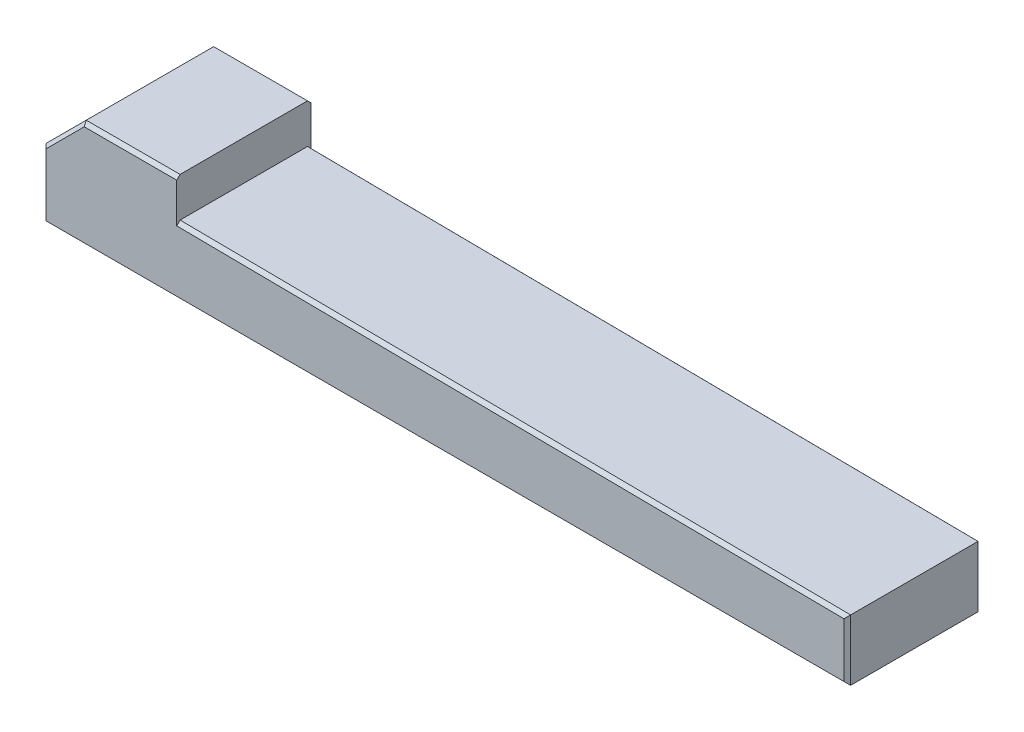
ISO-10303-21;
HEADER;
FILE_DESCRIPTION(('STEP AP214'),'2;1');
FILE_NAME('part.step','',(''),(''),'','','');
FILE_SCHEMA(('AUTOMOTIVE_DESIGN { 1 0 10303 214 1 1 1 1 }'));
ENDSEC;
DATA;
#1=APPLICATION_CONTEXT('core data for automotive mechanical design processes');
#2=APPLICATION_PROTOCOL_DEFINITION('international standard','automotive_design',2000,#1);
#3=PRODUCT_CONTEXT('',#1,'mechanical');
#4=PRODUCT('Part','Part','',(#3));
#5=PRODUCT_RELATED_PRODUCT_CATEGORY('part','',(#4));
#6=PRODUCT_DEFINITION_FORMATION('','',#4);
#7=PRODUCT_DEFINITION_CONTEXT('part definition',#1,'design');
#8=PRODUCT_DEFINITION('design','',#6,#7);
#9=PRODUCT_DEFINITION_SHAPE('','',#8);
#10=(LENGTH_UNIT() NAMED_UNIT(*) SI_UNIT(.MILLI.,.METRE.));
#11=(NAMED_UNIT(*) PLANE_ANGLE_UNIT() SI_UNIT($,.RADIAN.));
#12=(NAMED_UNIT(*) SI_UNIT($,.STERADIAN.) SOLID_ANGLE_UNIT());
#13=UNCERTAINTY_MEASURE_WITH_UNIT(LENGTH_MEASURE(1.E-05),#10,'distance_accuracy_value','');
#14=(GEOMETRIC_REPRESENTATION_CONTEXT(3) GLOBAL_UNCERTAINTY_ASSIGNED_CONTEXT((#13)) GLOBAL_UNIT_ASSIGNED_CONTEXT((#10,
#11,#12)) REPRESENTATION_CONTEXT('',''));
#15=CARTESIAN_POINT('',(0.,0.,0.));
#16=DIRECTION('',(0.,0.,1.));
#17=DIRECTION('',(1.,0.,0.));
#18=AXIS2_PLACEMENT_3D('',#15,#16,#17);
#19=CARTESIAN_POINT('',(0.,50.,50.));
#20=DIRECTION('',(1.,0.,0.));
#21=DIRECTION('',(0.,1.,0.));
#22=AXIS2_PLACEMENT_3D('',#19,#20,#21);
#23=PLANE('',#22);
#24=DIRECTION('',(0.,0.,-1.));
#25=VECTOR('',#24,1.);
#26=CARTESIAN_POINT('',(0.,50.,50.));
#27=LINE('',#26,#25);
#28=CARTESIAN_POINT('',(0.,50.,47.4999999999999));
#29=VERTEX_POINT('',#28);
#30=CARTESIAN_POINT('',(0.,50.,-47.5));
#31=VERTEX_POINT('',#30);
#32=EDGE_CURVE('E148',#29,#31,#27,.T.);
#33=ORIENTED_EDGE('',*,*,#32,.T.);
#34=DIRECTION('',(0.,-1.,0.));
#35=VECTOR('',#34,1.);
#36=CARTESIAN_POINT('',(0.,50.,-47.5));
#37=LINE('',#36,#35);
#38=CARTESIAN_POINT('',(0.,0.,-47.5));
#39=VERTEX_POINT('',#38);
#40=EDGE_CURVE('E256',#31,#39,#37,.T.);
#41=ORIENTED_EDGE('',*,*,#40,.T.);
#42=DIRECTION('',(0.,0.,-1.));
#43=VECTOR('',#42,1.);
#44=CARTESIAN_POINT('',(0.,0.,50.));
#45=LINE('',#44,#43);
#46=CARTESIAN_POINT('',(0.,0.,47.4999999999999));
#47=VERTEX_POINT('',#46);
#48=EDGE_CURVE('E169',#47,#39,#45,.T.);
#49=ORIENTED_EDGE('',*,*,#48,.F.);
#50=DIRECTION('',(0.,1.,0.));
#51=VECTOR('',#50,1.);
#52=CARTESIAN_POINT('',(0.,50.,47.4999999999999));
#53=LINE('',#52,#51);
#54=EDGE_CURVE('E253',#47,#29,#53,.T.);
#55=ORIENTED_EDGE('',*,*,#54,.T.);
#56=EDGE_LOOP('',(#33,#41,#49,#55));
#57=FACE_BOUND('',#56,.T.);
#58=ADVANCED_FACE('F39',(#57),#23,.F.);
#59=CARTESIAN_POINT('',(0.,0.,50.));
#60=DIRECTION('',(0.,1.,0.));
#61=DIRECTION('',(0.,0.,1.));
#62=AXIS2_PLACEMENT_3D('',#59,#60,#61);
#63=PLANE('',#62);
#64=ORIENTED_EDGE('',*,*,#48,.T.);
#65=DIRECTION('',(1.,0.,0.));
#66=VECTOR('',#65,1.);
#67=CARTESIAN_POINT('',(0.,0.,-47.5));
#68=LINE('',#67,#66);
#69=CARTESIAN_POINT('',(600.,0.,-47.5));
#70=VERTEX_POINT('',#69);
#71=EDGE_CURVE('E263',#39,#70,#68,.T.);
#72=ORIENTED_EDGE('',*,*,#71,.T.);
#73=DIRECTION('',(0.,0.,-1.));
#74=VECTOR('',#73,1.);
#75=CARTESIAN_POINT('',(600.,0.,50.));
#76=LINE('',#75,#74);
#77=CARTESIAN_POINT('',(600.,0.,47.4999999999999));
#78=VERTEX_POINT('',#77);
#79=EDGE_CURVE('E234',#78,#70,#76,.T.);
#80=ORIENTED_EDGE('',*,*,#79,.F.);
#81=DIRECTION('',(-1.,0.,0.));
#82=VECTOR('',#81,1.);
#83=CARTESIAN_POINT('',(0.,0.,47.4999999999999));
#84=LINE('',#83,#82);
#85=EDGE_CURVE('E258',#78,#47,#84,.T.);
#86=ORIENTED_EDGE('',*,*,#85,.T.);
#87=EDGE_LOOP('',(#64,#72,#80,#86));
#88=FACE_BOUND('',#87,.T.);
#89=ADVANCED_FACE('F310',(#88),#63,.F.);
#90=CARTESIAN_POINT('',(600.,0.,50.));
#91=DIRECTION('',(-1.,0.,0.));
#92=DIRECTION('',(0.,-1.,0.));
#93=AXIS2_PLACEMENT_3D('',#90,#91,#92);
#94=PLANE('',#93);
#95=ORIENTED_EDGE('',*,*,#79,.T.);
#96=DIRECTION('',(0.,1.,0.));
#97=VECTOR('',#96,1.);
#98=CARTESIAN_POINT('',(600.,0.,-47.5));
#99=LINE('',#98,#97);
#100=CARTESIAN_POINT('',(600.,45.4995184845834,-47.5));
#101=VERTEX_POINT('',#100);
#102=EDGE_CURVE('E261',#70,#101,#99,.T.);
#103=ORIENTED_EDGE('',*,*,#102,.T.);
#104=DIRECTION('',(0.,0.,-1.));
#105=VECTOR('',#104,1.);
#106=CARTESIAN_POINT('',(600.,45.4995184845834,50.));
#107=LINE('',#106,#105);
#108=CARTESIAN_POINT('',(600.,45.4995184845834,47.4999999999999));
#109=VERTEX_POINT('',#108);
#110=EDGE_CURVE('E233',#109,#101,#107,.T.);
#111=ORIENTED_EDGE('',*,*,#110,.F.);
#112=DIRECTION('',(0.,-1.,0.));
#113=VECTOR('',#112,1.);
#114=CARTESIAN_POINT('',(600.,0.,47.4999999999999));
#115=LINE('',#114,#113);
#116=EDGE_CURVE('E262',#109,#78,#115,.T.);
#117=ORIENTED_EDGE('',*,*,#116,.T.);
#118=EDGE_LOOP('',(#95,#103,#111,#117));
#119=FACE_BOUND('',#118,.T.);
#120=ADVANCED_FACE('F307',(#119),#94,.F.);
#121=CARTESIAN_POINT('',(600.,45.4995184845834,50.));
#122=DIRECTION('',(-0.0100005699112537,-0.999949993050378,0.));
#123=DIRECTION('',(0.999949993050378,-0.0100005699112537,0.));
#124=AXIS2_PLACEMENT_3D('',#121,#122,#123);
#125=PLANE('',#124);
#126=ORIENTED_EDGE('',*,*,#110,.T.);
#127=DIRECTION('',(-0.999949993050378,0.0100005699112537,0.));
#128=VECTOR('',#127,1.);
#129=CARTESIAN_POINT('',(600.,45.4995184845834,-47.5));
#130=LINE('',#129,#128);
#131=CARTESIAN_POINT('',(100.,50.500053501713,-47.5));
#132=VERTEX_POINT('',#131);
#133=EDGE_CURVE('E268',#101,#132,#130,.T.);
#134=ORIENTED_EDGE('',*,*,#133,.T.);
#135=DIRECTION('',(0.,0.,-1.));
#136=VECTOR('',#135,1.);
#137=CARTESIAN_POINT('',(100.,50.500053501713,50.));
#138=LINE('',#137,#136);
#139=CARTESIAN_POINT('',(100.,50.500053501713,47.4999999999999));
#140=VERTEX_POINT('',#139);
#141=EDGE_CURVE('E226',#140,#132,#138,.T.);
#142=ORIENTED_EDGE('',*,*,#141,.F.);
#143=DIRECTION('',(0.999949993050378,-0.0100005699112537,0.));
#144=VECTOR('',#143,1.);
#145=CARTESIAN_POINT('',(600.,45.4995184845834,47.4999999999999));
#146=LINE('',#145,#144);
#147=EDGE_CURVE('E266',#140,#109,#146,.T.);
#148=ORIENTED_EDGE('',*,*,#147,.T.);
#149=EDGE_LOOP('',(#126,#134,#142,#148));
#150=FACE_BOUND('',#149,.T.);
#151=ADVANCED_FACE('F454',(#150),#125,.F.);
#152=CARTESIAN_POINT('',(100.,50.500053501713,50.));
#153=DIRECTION('',(-1.,0.,0.));
#154=DIRECTION('',(0.,-1.,0.));
#155=AXIS2_PLACEMENT_3D('',#152,#153,#154);
#156=PLANE('',#155);
#157=DIRECTION('',(0.,1.,0.));
#158=VECTOR('',#157,1.);
#159=CARTESIAN_POINT('',(100.,50.500053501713,-50.));
#160=LINE('',#159,#158);
#161=CARTESIAN_POINT('',(100.,47.9999284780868,-50.));
#162=VERTEX_POINT('',#161);
#163=CARTESIAN_POINT('',(100.,77.5,-50.));
#164=VERTEX_POINT('',#163);
#165=EDGE_CURVE('E211',#162,#164,#160,.T.);
#166=ORIENTED_EDGE('',*,*,#165,.T.);
#167=DIRECTION('',(0.,-0.707106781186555,-0.707106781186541));
#168=VECTOR('',#167,1.);
#169=CARTESIAN_POINT('',(100.,80.,-47.5));
#170=LINE('',#169,#168);
#171=CARTESIAN_POINT('',(100.,80.,-47.5));
#172=VERTEX_POINT('',#171);
#173=EDGE_CURVE('E155',#164,#172,#170,.F.);
#174=ORIENTED_EDGE('',*,*,#173,.T.);
#175=DIRECTION('',(0.,0.,-1.));
#176=VECTOR('',#175,1.);
#177=CARTESIAN_POINT('',(100.,80.,50.));
#178=LINE('',#177,#176);
#179=CARTESIAN_POINT('',(100.,80.,47.4999999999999));
#180=VERTEX_POINT('',#179);
#181=EDGE_CURVE('E165',#180,#172,#178,.T.);
#182=ORIENTED_EDGE('',*,*,#181,.F.);
#183=DIRECTION('',(0.,-0.707106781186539,0.707106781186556));
#184=VECTOR('',#183,1.);
#185=CARTESIAN_POINT('',(100.,77.5,50.));
#186=LINE('',#185,#184);
#187=CARTESIAN_POINT('',(100.,77.5,50.));
#188=VERTEX_POINT('',#187);
#189=EDGE_CURVE('E166',#180,#188,#186,.T.);
#190=ORIENTED_EDGE('',*,*,#189,.T.);
#191=DIRECTION('',(0.,1.,0.));
#192=VECTOR('',#191,1.);
#193=CARTESIAN_POINT('',(100.,50.500053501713,50.));
#194=LINE('',#193,#192);
#195=CARTESIAN_POINT('',(100.,47.9999284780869,50.));
#196=VERTEX_POINT('',#195);
#197=EDGE_CURVE('E217',#196,#188,#194,.T.);
#198=ORIENTED_EDGE('',*,*,#197,.F.);
#199=DIRECTION('',(0.,0.707124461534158,-0.70708910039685));
#200=VECTOR('',#199,1.);
#201=CARTESIAN_POINT('',(100.,49.2500535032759,48.74993748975));
#202=LINE('',#201,#200);
#203=EDGE_CURVE('E11',#196,#140,#202,.T.);
#204=ORIENTED_EDGE('',*,*,#203,.T.);
#205=ORIENTED_EDGE('',*,*,#141,.T.);
#206=DIRECTION('',(0.,0.707124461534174,0.707089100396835));
#207=VECTOR('',#206,1.);
#208=CARTESIAN_POINT('',(100.,99.2500534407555,1.24756210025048));
#209=LINE('',#208,#207);
#210=EDGE_CURVE('E48',#132,#162,#209,.F.);
#211=ORIENTED_EDGE('',*,*,#210,.T.);
#212=EDGE_LOOP('',(#166,#174,#182,#190,#198,#204,#205,#211));
#213=FACE_BOUND('',#212,.T.);
#214=ADVANCED_FACE('F285',(#213),#156,.F.);
#215=CARTESIAN_POINT('',(100.,80.,50.));
#216=DIRECTION('',(0.,-1.,0.));
#217=DIRECTION('',(1.,0.,0.));
#218=AXIS2_PLACEMENT_3D('',#215,#216,#217);
#219=PLANE('',#218);
#220=ORIENTED_EDGE('',*,*,#181,.T.);
#221=DIRECTION('',(-1.,0.,0.));
#222=VECTOR('',#221,1.);
#223=CARTESIAN_POINT('',(100.,80.,-47.5));
#224=LINE('',#223,#222);
#225=CARTESIAN_POINT('',(30.0000000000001,80.,-47.5));
#226=VERTEX_POINT('',#225);
#227=EDGE_CURVE('E161',#172,#226,#224,.T.);
#228=ORIENTED_EDGE('',*,*,#227,.T.);
#229=DIRECTION('',(0.,0.,-1.));
#230=VECTOR('',#229,1.);
#231=CARTESIAN_POINT('',(30.0000000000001,80.,50.));
#232=LINE('',#231,#230);
#233=CARTESIAN_POINT('',(30.0000000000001,80.,47.4999999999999));
#234=VERTEX_POINT('',#233);
#235=EDGE_CURVE('E146',#234,#226,#232,.T.);
#236=ORIENTED_EDGE('',*,*,#235,.F.);
#237=DIRECTION('',(1.,0.,0.));
#238=VECTOR('',#237,1.);
#239=CARTESIAN_POINT('',(100.,80.,47.4999999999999));
#240=LINE('',#239,#238);
#241=EDGE_CURVE('E157',#234,#180,#240,.T.);
#242=ORIENTED_EDGE('',*,*,#241,.T.);
#243=EDGE_LOOP('',(#220,#228,#236,#242));
#244=FACE_BOUND('',#243,.T.);
#245=ADVANCED_FACE('F158',(#244),#219,.F.);
#246=CARTESIAN_POINT('',(30.0000000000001,80.,50.));
#247=DIRECTION('',(0.707106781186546,-0.707106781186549,0.));
#248=DIRECTION('',(0.707106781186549,0.707106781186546,0.));
#249=AXIS2_PLACEMENT_3D('',#246,#247,#248);
#250=PLANE('',#249);
#251=ORIENTED_EDGE('',*,*,#235,.T.);
#252=DIRECTION('',(-0.707106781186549,-0.707106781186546,0.));
#253=VECTOR('',#252,1.);
#254=CARTESIAN_POINT('',(30.0000000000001,80.,-47.5));
#255=LINE('',#254,#253);
#256=EDGE_CURVE('E152',#226,#31,#255,.T.);
#257=ORIENTED_EDGE('',*,*,#256,.T.);
#258=ORIENTED_EDGE('',*,*,#32,.F.);
#259=DIRECTION('',(0.707106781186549,0.707106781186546,0.));
#260=VECTOR('',#259,1.);
#261=CARTESIAN_POINT('',(30.0000000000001,80.,47.4999999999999));
#262=LINE('',#261,#260);
#263=EDGE_CURVE('E144',#29,#234,#262,.T.);
#264=ORIENTED_EDGE('',*,*,#263,.T.);
#265=EDGE_LOOP('',(#251,#257,#258,#264));
#266=FACE_BOUND('',#265,.T.);
#267=ADVANCED_FACE('F149',(#266),#250,.F.);
#268=CARTESIAN_POINT('',(0.,0.,50.));
#269=DIRECTION('',(0.,0.,1.));
#270=DIRECTION('',(1.,0.,0.));
#271=AXIS2_PLACEMENT_3D('',#268,#269,#270);
#272=PLANE('',#271);
#273=ORIENTED_EDGE('',*,*,#197,.T.);
#274=DIRECTION('',(-1.,0.,0.));
#275=VECTOR('',#274,1.);
#276=CARTESIAN_POINT('',(30.0000000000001,77.5,50.));
#277=LINE('',#276,#275);
#278=CARTESIAN_POINT('',(31.0355339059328,77.5,50.));
#279=VERTEX_POINT('',#278);
#280=EDGE_CURVE('E283',#188,#279,#277,.T.);
#281=ORIENTED_EDGE('',*,*,#280,.T.);
#282=DIRECTION('',(-0.707106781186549,-0.707106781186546,0.));
#283=VECTOR('',#282,1.);
#284=CARTESIAN_POINT('',(1.76776695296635,48.2322330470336,50.));
#285=LINE('',#284,#283);
#286=CARTESIAN_POINT('',(2.49999999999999,48.9644660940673,50.));
#287=VERTEX_POINT('',#286);
#288=EDGE_CURVE('E65',#279,#287,#285,.T.);
#289=ORIENTED_EDGE('',*,*,#288,.T.);
#290=DIRECTION('',(0.,-1.,0.));
#291=VECTOR('',#290,1.);
#292=CARTESIAN_POINT('',(2.49999999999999,0.,50.));
#293=LINE('',#292,#291);
#294=CARTESIAN_POINT('',(2.49999999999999,2.49999999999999,50.));
#295=VERTEX_POINT('',#294);
#296=EDGE_CURVE('E280',#287,#295,#293,.T.);
#297=ORIENTED_EDGE('',*,*,#296,.T.);
#298=DIRECTION('',(1.,0.,0.));
#299=VECTOR('',#298,1.);
#300=CARTESIAN_POINT('',(600.,2.49999999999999,50.));
#301=LINE('',#300,#299);
#302=CARTESIAN_POINT('',(597.5,2.49999999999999,50.));
#303=VERTEX_POINT('',#302);
#304=EDGE_CURVE('E279',#295,#303,#301,.T.);
#305=ORIENTED_EDGE('',*,*,#304,.T.);
#306=DIRECTION('',(0.,1.,0.));
#307=VECTOR('',#306,1.);
#308=CARTESIAN_POINT('',(597.5,45.4995184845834,50.));
#309=LINE('',#308,#307);
#310=CARTESIAN_POINT('',(597.5,43.0243961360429,50.));
#311=VERTEX_POINT('',#310);
#312=EDGE_CURVE('E274',#303,#311,#309,.T.);
#313=ORIENTED_EDGE('',*,*,#312,.T.);
#314=DIRECTION('',(-0.999949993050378,0.0100005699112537,0.));
#315=VECTOR('',#314,1.);
#316=CARTESIAN_POINT('',(99.9749985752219,48.000178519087,50.));
#317=LINE('',#316,#315);
#318=EDGE_CURVE('E272',#311,#196,#317,.T.);
#319=ORIENTED_EDGE('',*,*,#318,.T.);
#320=EDGE_LOOP('',(#273,#281,#289,#297,#305,#313,#319));
#321=FACE_BOUND('',#320,.T.);
#322=ADVANCED_FACE('F422',(#321),#272,.T.);
#323=CARTESIAN_POINT('',(0.,0.,-50.));
#324=DIRECTION('',(0.,0.,1.));
#325=DIRECTION('',(1.,0.,0.));
#326=AXIS2_PLACEMENT_3D('',#323,#324,#325);
#327=PLANE('',#326);
#328=DIRECTION('',(0.707106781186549,0.707106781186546,0.));
#329=VECTOR('',#328,1.);
#330=CARTESIAN_POINT('',(-23.2322330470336,23.2322330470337,-50.));
#331=LINE('',#330,#329);
#332=CARTESIAN_POINT('',(2.50000000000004,48.9644660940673,-50.));
#333=VERTEX_POINT('',#332);
#334=CARTESIAN_POINT('',(31.0355339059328,77.4999999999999,-50.));
#335=VERTEX_POINT('',#334);
#336=EDGE_CURVE('E247',#333,#335,#331,.T.);
#337=ORIENTED_EDGE('',*,*,#336,.T.);
#338=DIRECTION('',(1.,0.,0.));
#339=VECTOR('',#338,1.);
#340=CARTESIAN_POINT('',(0.,77.4999999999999,-50.));
#341=LINE('',#340,#339);
#342=EDGE_CURVE('E249',#335,#164,#341,.T.);
#343=ORIENTED_EDGE('',*,*,#342,.T.);
#344=ORIENTED_EDGE('',*,*,#165,.F.);
#345=DIRECTION('',(0.999949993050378,-0.0100005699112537,0.));
#346=VECTOR('',#345,1.);
#347=CARTESIAN_POINT('',(0.490003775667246,48.9951349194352,-50.));
#348=LINE('',#347,#346);
#349=CARTESIAN_POINT('',(597.5,43.0243961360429,-50.));
#350=VERTEX_POINT('',#349);
#351=EDGE_CURVE('E239',#162,#350,#348,.T.);
#352=ORIENTED_EDGE('',*,*,#351,.T.);
#353=DIRECTION('',(0.,-1.,0.));
#354=VECTOR('',#353,1.);
#355=CARTESIAN_POINT('',(597.5,-1.45794566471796E-12,-50.));
#356=LINE('',#355,#354);
#357=CARTESIAN_POINT('',(597.5,2.50000000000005,-50.));
#358=VERTEX_POINT('',#357);
#359=EDGE_CURVE('E245',#350,#358,#356,.T.);
#360=ORIENTED_EDGE('',*,*,#359,.T.);
#361=DIRECTION('',(-1.,0.,0.));
#362=VECTOR('',#361,1.);
#363=CARTESIAN_POINT('',(0.,2.50000000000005,-50.));
#364=LINE('',#363,#362);
#365=CARTESIAN_POINT('',(2.50000000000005,2.50000000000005,-50.));
#366=VERTEX_POINT('',#365);
#367=EDGE_CURVE('E242',#358,#366,#364,.T.);
#368=ORIENTED_EDGE('',*,*,#367,.T.);
#369=DIRECTION('',(0.,1.,0.));
#370=VECTOR('',#369,1.);
#371=CARTESIAN_POINT('',(2.50000000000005,0.,-50.));
#372=LINE('',#371,#370);
#373=EDGE_CURVE('E246',#366,#333,#372,.T.);
#374=ORIENTED_EDGE('',*,*,#373,.T.);
#375=EDGE_LOOP('',(#337,#343,#344,#352,#360,#368,#374));
#376=FACE_BOUND('',#375,.T.);
#377=ADVANCED_FACE('F287',(#376),#327,.F.);
#378=CARTESIAN_POINT('',(600.,45.4995184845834,-47.5));
#379=DIRECTION('',(-0.00707147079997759,-0.707071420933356,0.707106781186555));
#380=DIRECTION('',(0.,-0.707124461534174,-0.707089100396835));
#381=AXIS2_PLACEMENT_3D('',#378,#379,#380);
#382=PLANE('',#381);
#383=ORIENTED_EDGE('',*,*,#210,.F.);
#384=ORIENTED_EDGE('',*,*,#133,.F.);
#385=DIRECTION('',(-0.579265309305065,-0.573501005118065,-0.579265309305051));
#386=VECTOR('',#385,1.);
#387=CARTESIAN_POINT('',(600.,45.4995184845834,-47.5));
#388=LINE('',#387,#386);
#389=EDGE_CURVE('E180',#350,#101,#388,.F.);
#390=ORIENTED_EDGE('',*,*,#389,.F.);
#391=ORIENTED_EDGE('',*,*,#351,.F.);
#392=EDGE_LOOP('',(#383,#384,#390,#391));
#393=FACE_BOUND('',#392,.T.);
#394=ADVANCED_FACE('F290',(#393),#382,.F.);
#395=CARTESIAN_POINT('',(600.,0.,-47.5));
#396=DIRECTION('',(-0.70710678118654,0.,0.707106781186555));
#397=DIRECTION('',(0.707106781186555,0.,0.70710678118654));
#398=AXIS2_PLACEMENT_3D('',#395,#396,#397);
#399=PLANE('',#398);
#400=ORIENTED_EDGE('',*,*,#389,.T.);
#401=ORIENTED_EDGE('',*,*,#102,.F.);
#402=DIRECTION('',(-0.57735026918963,0.577350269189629,-0.577350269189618));
#403=VECTOR('',#402,1.);
#404=CARTESIAN_POINT('',(600.,0.,-47.5));
#405=LINE('',#404,#403);
#406=EDGE_CURVE('E202',#358,#70,#405,.F.);
#407=ORIENTED_EDGE('',*,*,#406,.F.);
#408=ORIENTED_EDGE('',*,*,#359,.F.);
#409=EDGE_LOOP('',(#400,#401,#407,#408));
#410=FACE_BOUND('',#409,.T.);
#411=ADVANCED_FACE('F311',(#410),#399,.F.);
#412=CARTESIAN_POINT('',(0.,0.,-47.5));
#413=DIRECTION('',(0.,0.707106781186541,0.707106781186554));
#414=DIRECTION('',(0.,-0.707106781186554,0.707106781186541));
#415=AXIS2_PLACEMENT_3D('',#412,#413,#414);
#416=PLANE('',#415);
#417=ORIENTED_EDGE('',*,*,#406,.T.);
#418=ORIENTED_EDGE('',*,*,#71,.F.);
#419=DIRECTION('',(0.577350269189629,0.577350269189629,-0.577350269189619));
#420=VECTOR('',#419,1.);
#421=CARTESIAN_POINT('',(0.,0.,-47.5));
#422=LINE('',#421,#420);
#423=EDGE_CURVE('E196',#366,#39,#422,.F.);
#424=ORIENTED_EDGE('',*,*,#423,.F.);
#425=ORIENTED_EDGE('',*,*,#367,.F.);
#426=EDGE_LOOP('',(#417,#418,#424,#425));
#427=FACE_BOUND('',#426,.T.);
#428=ADVANCED_FACE('F302',(#427),#416,.F.);
#429=CARTESIAN_POINT('',(0.,50.,-47.5));
#430=DIRECTION('',(0.707106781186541,0.,0.707106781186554));
#431=DIRECTION('',(0.707106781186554,0.,-0.707106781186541));
#432=AXIS2_PLACEMENT_3D('',#429,#430,#431);
#433=PLANE('',#432);
#434=ORIENTED_EDGE('',*,*,#423,.T.);
#435=ORIENTED_EDGE('',*,*,#40,.F.);
#436=DIRECTION('',(0.678598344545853,-0.281084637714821,-0.67859834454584));
#437=VECTOR('',#436,1.);
#438=CARTESIAN_POINT('',(0.,50.,-47.5));
#439=LINE('',#438,#437);
#440=EDGE_CURVE('E195',#333,#31,#439,.F.);
#441=ORIENTED_EDGE('',*,*,#440,.F.);
#442=ORIENTED_EDGE('',*,*,#373,.F.);
#443=EDGE_LOOP('',(#434,#435,#441,#442));
#444=FACE_BOUND('',#443,.T.);
#445=ADVANCED_FACE('F301',(#444),#433,.F.);
#446=CARTESIAN_POINT('',(30.0000000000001,80.,-47.5));
#447=DIRECTION('',(0.499999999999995,-0.499999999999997,0.707106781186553));
#448=DIRECTION('',(0.,-0.81649658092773,-0.57735026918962));
#449=AXIS2_PLACEMENT_3D('',#446,#447,#448);
#450=PLANE('',#449);
#451=ORIENTED_EDGE('',*,*,#440,.T.);
#452=ORIENTED_EDGE('',*,*,#256,.F.);
#453=DIRECTION('',(0.281084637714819,-0.678598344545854,-0.678598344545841));
#454=VECTOR('',#453,1.);
#455=CARTESIAN_POINT('',(30.0000000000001,80.,-47.5));
#456=LINE('',#455,#454);
#457=EDGE_CURVE('E189',#335,#226,#456,.F.);
#458=ORIENTED_EDGE('',*,*,#457,.F.);
#459=ORIENTED_EDGE('',*,*,#336,.F.);
#460=EDGE_LOOP('',(#451,#452,#458,#459));
#461=FACE_BOUND('',#460,.T.);
#462=ADVANCED_FACE('F295',(#461),#450,.F.);
#463=CARTESIAN_POINT('',(100.,80.,-47.5));
#464=DIRECTION('',(0.,-0.70710678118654,0.707106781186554));
#465=DIRECTION('',(0.,-0.707106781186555,-0.707106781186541));
#466=AXIS2_PLACEMENT_3D('',#463,#464,#465);
#467=PLANE('',#466);
#468=ORIENTED_EDGE('',*,*,#173,.F.);
#469=ORIENTED_EDGE('',*,*,#342,.F.);
#470=ORIENTED_EDGE('',*,*,#457,.T.);
#471=ORIENTED_EDGE('',*,*,#227,.F.);
#472=EDGE_LOOP('',(#468,#469,#470,#471));
#473=FACE_BOUND('',#472,.T.);
#474=ADVANCED_FACE('F292',(#473),#467,.F.);
#475=CARTESIAN_POINT('',(0.490003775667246,48.9951349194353,50.));
#476=DIRECTION('',(0.00707147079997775,0.707071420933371,0.707106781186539));
#477=DIRECTION('',(0.,-0.707124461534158,0.70708910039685));
#478=AXIS2_PLACEMENT_3D('',#475,#476,#477);
#479=PLANE('',#478);
#480=ORIENTED_EDGE('',*,*,#203,.F.);
#481=ORIENTED_EDGE('',*,*,#318,.F.);
#482=DIRECTION('',(0.579265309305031,0.573501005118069,-0.579265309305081));
#483=VECTOR('',#482,1.);
#484=CARTESIAN_POINT('',(399.157846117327,-153.344042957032,248.342153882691));
#485=LINE('',#484,#483);
#486=EDGE_CURVE('E43',#109,#311,#485,.F.);
#487=ORIENTED_EDGE('',*,*,#486,.F.);
#488=ORIENTED_EDGE('',*,*,#147,.F.);
#489=EDGE_LOOP('',(#480,#481,#487,#488));
#490=FACE_BOUND('',#489,.T.);
#491=ADVANCED_FACE('F41',(#490),#479,.T.);
#492=CARTESIAN_POINT('',(597.5,-1.45794566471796E-12,50.));
#493=DIRECTION('',(0.707106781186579,0.,0.707106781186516));
#494=DIRECTION('',(0.707106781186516,0.,-0.707106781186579));
#495=AXIS2_PLACEMENT_3D('',#492,#493,#494);
#496=PLANE('',#495);
#497=ORIENTED_EDGE('',*,*,#486,.T.);
#498=ORIENTED_EDGE('',*,*,#312,.F.);
#499=DIRECTION('',(0.577350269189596,-0.577350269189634,-0.577350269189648));
#500=VECTOR('',#499,1.);
#501=CARTESIAN_POINT('',(598.333333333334,1.66666666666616,49.1666666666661));
#502=LINE('',#501,#500);
#503=EDGE_CURVE('E181',#78,#303,#502,.F.);
#504=ORIENTED_EDGE('',*,*,#503,.F.);
#505=ORIENTED_EDGE('',*,*,#116,.F.);
#506=EDGE_LOOP('',(#497,#498,#504,#505));
#507=FACE_BOUND('',#506,.T.);
#508=ADVANCED_FACE('F353',(#507),#496,.T.);
#509=CARTESIAN_POINT('',(0.,2.49999999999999,50.));
#510=DIRECTION('',(0.,-0.707106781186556,0.707106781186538));
#511=DIRECTION('',(0.,-0.707106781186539,-0.707106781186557));
#512=AXIS2_PLACEMENT_3D('',#509,#510,#511);
#513=PLANE('',#512);
#514=ORIENTED_EDGE('',*,*,#503,.T.);
#515=ORIENTED_EDGE('',*,*,#304,.F.);
#516=DIRECTION('',(-0.577350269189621,-0.577350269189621,-0.577350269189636));
#517=VECTOR('',#516,1.);
#518=CARTESIAN_POINT('',(1.66666666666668,1.66666666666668,49.1666666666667));
#519=LINE('',#518,#517);
#520=EDGE_CURVE('E172',#47,#295,#519,.F.);
#521=ORIENTED_EDGE('',*,*,#520,.F.);
#522=ORIENTED_EDGE('',*,*,#85,.F.);
#523=EDGE_LOOP('',(#514,#515,#521,#522));
#524=FACE_BOUND('',#523,.T.);
#525=ADVANCED_FACE('F365',(#524),#513,.T.);
#526=CARTESIAN_POINT('',(2.49999999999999,0.,50.));
#527=DIRECTION('',(-0.707106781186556,0.,0.707106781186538));
#528=DIRECTION('',(0.707106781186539,0.,0.707106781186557));
#529=AXIS2_PLACEMENT_3D('',#526,#527,#528);
#530=PLANE('',#529);
#531=ORIENTED_EDGE('',*,*,#520,.T.);
#532=ORIENTED_EDGE('',*,*,#296,.F.);
#533=DIRECTION('',(-0.678598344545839,0.281084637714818,-0.678598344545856));
#534=VECTOR('',#533,1.);
#535=CARTESIAN_POINT('',(11.8396570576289,45.0958534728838,59.3396570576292));
#536=LINE('',#535,#534);
#537=EDGE_CURVE('E175',#29,#287,#536,.F.);
#538=ORIENTED_EDGE('',*,*,#537,.F.);
#539=ORIENTED_EDGE('',*,*,#54,.F.);
#540=EDGE_LOOP('',(#531,#532,#538,#539));
#541=FACE_BOUND('',#540,.T.);
#542=ADVANCED_FACE('F367',(#541),#530,.T.);
#543=CARTESIAN_POINT('',(-23.2322330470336,23.2322330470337,50.));
#544=DIRECTION('',(-0.500000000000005,0.500000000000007,0.707106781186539));
#545=DIRECTION('',(0.,-0.816496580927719,0.577350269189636));
#546=AXIS2_PLACEMENT_3D('',#543,#544,#545);
#547=PLANE('',#546);
#548=ORIENTED_EDGE('',*,*,#537,.T.);
#549=ORIENTED_EDGE('',*,*,#288,.F.);
#550=DIRECTION('',(-0.281084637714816,0.67859834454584,-0.678598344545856));
#551=VECTOR('',#550,1.);
#552=CARTESIAN_POINT('',(37.0991426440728,62.8611535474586,64.6388464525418));
#553=LINE('',#552,#551);
#554=EDGE_CURVE('E57',#234,#279,#553,.F.);
#555=ORIENTED_EDGE('',*,*,#554,.F.);
#556=ORIENTED_EDGE('',*,*,#263,.F.);
#557=EDGE_LOOP('',(#548,#549,#555,#556));
#558=FACE_BOUND('',#557,.T.);
#559=ADVANCED_FACE('F171',(#558),#547,.T.);
#560=CARTESIAN_POINT('',(0.,77.5,50.));
#561=DIRECTION('',(0.,0.707106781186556,0.707106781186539));
#562=DIRECTION('',(0.,-0.707106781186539,0.707106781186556));
#563=AXIS2_PLACEMENT_3D('',#560,#561,#562);
#564=PLANE('',#563);
#565=ORIENTED_EDGE('',*,*,#189,.F.);
#566=ORIENTED_EDGE('',*,*,#241,.F.);
#567=ORIENTED_EDGE('',*,*,#554,.T.);
#568=ORIENTED_EDGE('',*,*,#280,.F.);
#569=EDGE_LOOP('',(#565,#566,#567,#568));
#570=FACE_BOUND('',#569,.T.);
#571=ADVANCED_FACE('F170',(#570),#564,.T.);
#572=CLOSED_SHELL('',(#58,#89,#120,#151,#214,#245,#267,#322,#377,#394,#411,#428,#445,#462,#474,
#491,#508,#525,#542,#559,#571));
#573=MANIFOLD_SOLID_BREP('B2',#572);
#574=ADVANCED_BREP_SHAPE_REPRESENTATION('',(#18,#573),#14);
#575=SHAPE_DEFINITION_REPRESENTATION(#9,#574);
ENDSEC;
END-ISO-10303-21;
